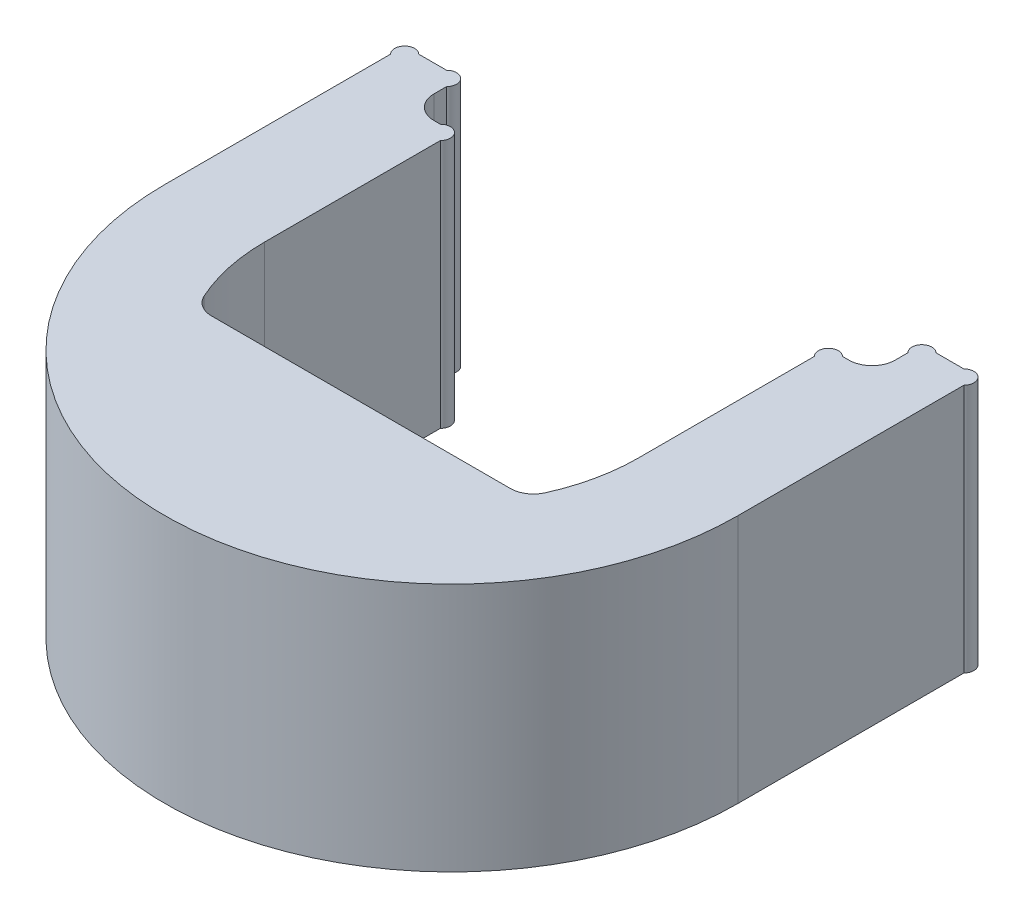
from build123d import *

# Parameters (mm, degrees)
BOSS_EXTRU_1_DEPTH = 40


with BuildPart() as part:
    # Esquisse1 → Boss.-Extru.1 (new body)
    with BuildSketch(Plane(origin=(0, 0, 0), x_dir=(1, 0, 0), z_dir=(0, 1, 0))):
        with BuildLine():
            Line((-23.980200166, -44.5), (23.980200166, -44.5))
            ThreePointArc((23.980200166, -44.5), (25.988713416, -43.907390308), (27.353840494, -42.319391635))
            ThreePointArc((27.353840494, -42.319391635), (29.331000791, -36.300189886), (30, -30))
            Line((30, -30), (30, -1.7627417))
            ThreePointArc((30, -1.7627417), (30, 0.5), (32.2627417, 0.5))
            Line((32.2627417, 0.5), (33.3, 0.5))
            ThreePointArc((33.3, 0.5), (35.91629509, 1.58370491), (37, 4.2))
            Line((37, 4.2), (37, 6.2372583))
            ThreePointArc((37, 6.2372583), (37, 8.5), (39.2627417, 8.5))
            Line((39.2627417, 8.5), (43.7372583, 8.5))
            ThreePointArc((43.7372583, 8.5), (46, 8.5), (46, 6.2372583))
            Line((46, 6.2372583), (46, -30))
            ThreePointArc((46, -30), (0, -76), (-46, -30))
            Line((-46, -30), (-46, 6.2372583))
            ThreePointArc((-46, 6.2372583), (-46, 8.5), (-43.7372583, 8.5))
            Line((-43.7372583, 8.5), (-39.2627417, 8.5))
            ThreePointArc((-39.2627417, 8.5), (-37, 8.5), (-37, 6.2372583))
            Line((-37, 6.2372583), (-37, 4.2))
            ThreePointArc((-37, 4.2), (-35.91629509, 1.58370491), (-33.3, 0.5))
            Line((-33.3, 0.5), (-32.2627417, 0.5))
            ThreePointArc((-32.2627417, 0.5), (-30, 0.5), (-30, -1.7627417))
            Line((-30, -1.7627417), (-30, -30))
            ThreePointArc((-30, -30), (-29.331000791, -36.300189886), (-27.353840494, -42.319391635))
            ThreePointArc((-27.353840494, -42.319391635), (-25.988713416, -43.907390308), (-23.980200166, -44.5))
        make_face()
    extrude(amount=BOSS_EXTRU_1_DEPTH)


solid = part.part
